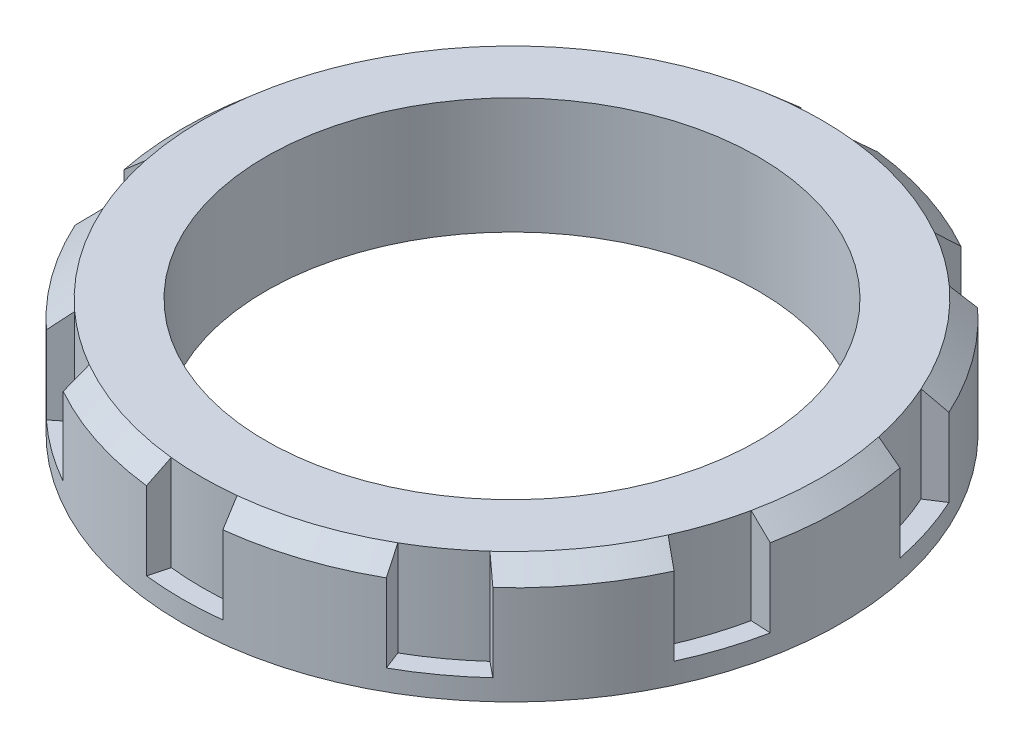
from build123d import *

# Parameters (mm, degrees)
CUT_EXTRUDE_START   = -5.5
SKETCH_2_R          = 25
CUT_EXTRUDE_1_DEPTH = 5.5


with BuildPart() as part:
    # Sketch 1 → Revolve 1 (revolve)
    with BuildSketch(Plane.XY, mode=Mode.PRIVATE) as revolve_1_sk:
        Polygon((-19, 5.7), (-19, 0), (-14.188, 0), (-14.188, 6.7), (-17.85, 6.7), align=None)
    revolve(revolve_1_sk.sketch.rotate(Axis((0, 6.7, 0), (0, -1, 0)), 90), axis=Axis((0, 6.7, 0), (0, -1, 0)))

    # Sketch 2 → Cut-Extrude 1 (cut)
    with BuildSketch(Plane(origin=(0, 6.7, 0), x_dir=(1, 0, 0), z_dir=(0, 1, 0)).offset(CUT_EXTRUDE_START)):
        Circle(SKETCH_2_R)
        with BuildLine():
            Line((-18.628367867, -3.739506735), (-17.467045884, -3.677609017))
            ThreePointArc((-17.467045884, -3.677609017), (-16.976358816, -5.51595335), (-16.292781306, -7.291623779))
            Line((-16.292781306, -7.291623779), (-17.268693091, -7.924155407))
            ThreePointArc((-17.268693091, -7.924155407), (-15.371322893, -11.167919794), (-12.872639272, -13.974804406))
            Line((-12.872639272, -13.974804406), (-11.969492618, -13.242120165))
            ThreePointArc((-11.969492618, -13.242120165), (-10.491966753, -14.44095335), (-8.895228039, -15.475704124))
            Line((-8.895228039, -15.475704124), (-9.312964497, -16.561059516))
            ThreePointArc((-9.312964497, -16.561059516), (-5.871322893, -18.07007381), (-2.2, -18.872201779))
            Line((-2.2, -18.872201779), (-1.9, -17.748591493))
            ThreePointArc((-1.9, -17.748591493), (0, -17.85), (1.9, -17.748591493))
            Line((1.9, -17.748591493), (2.2, -18.872201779))
            ThreePointArc((2.2, -18.872201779), (5.871322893, -18.07007381), (9.312964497, -16.561059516))
            Line((9.312964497, -16.561059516), (8.895228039, -15.475704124))
            ThreePointArc((8.895228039, -15.475704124), (10.491966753, -14.44095335), (11.969492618, -13.242120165))
            Line((11.969492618, -13.242120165), (12.872639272, -13.974804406))
            ThreePointArc((12.872639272, -13.974804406), (15.371322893, -11.167919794), (17.268693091, -7.924155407))
            Line((17.268693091, -7.924155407), (16.292781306, -7.291623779))
            ThreePointArc((16.292781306, -7.291623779), (16.976358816, -5.51595335), (17.467045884, -3.677609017))
            Line((17.467045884, -3.677609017), (18.628367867, -3.739506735))
            ThreePointArc((18.628367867, -3.739506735), (19, 0), (18.628367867, 3.739506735))
            Line((18.628367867, 3.739506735), (17.467045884, 3.677609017))
            ThreePointArc((17.467045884, 3.677609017), (16.976358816, 5.51595335), (16.292781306, 7.291623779))
            Line((16.292781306, 7.291623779), (17.268693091, 7.924155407))
            ThreePointArc((17.268693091, 7.924155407), (15.371322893, 11.167919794), (12.872639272, 13.974804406))
            Line((12.872639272, 13.974804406), (11.969492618, 13.242120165))
            ThreePointArc((11.969492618, 13.242120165), (10.491966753, 14.44095335), (8.895228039, 15.475704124))
            Line((8.895228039, 15.475704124), (9.312964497, 16.561059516))
            ThreePointArc((9.312964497, 16.561059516), (5.871322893, 18.07007381), (2.2, 18.872201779))
            Line((2.2, 18.872201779), (1.9, 17.748591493))
            ThreePointArc((1.9, 17.748591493), (0, 17.85), (-1.9, 17.748591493))
            Line((-1.9, 17.748591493), (-2.2, 18.872201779))
            ThreePointArc((-2.2, 18.872201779), (-5.871322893, 18.07007381), (-9.312964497, 16.561059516))
            Line((-9.312964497, 16.561059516), (-8.895228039, 15.475704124))
            ThreePointArc((-8.895228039, 15.475704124), (-10.491966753, 14.44095335), (-11.969492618, 13.242120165))
            Line((-11.969492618, 13.242120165), (-12.872639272, 13.974804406))
            ThreePointArc((-12.872639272, 13.974804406), (-15.371322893, 11.167919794), (-17.268693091, 7.924155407))
            Line((-17.268693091, 7.924155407), (-16.292781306, 7.291623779))
            ThreePointArc((-16.292781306, 7.291623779), (-16.976358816, 5.51595335), (-17.467045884, 3.677609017))
            Line((-17.467045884, 3.677609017), (-18.628367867, 3.739506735))
            ThreePointArc((-18.628367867, 3.739506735), (-19, 0), (-18.628367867, -3.739506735))
        make_face(mode=Mode.SUBTRACT)
    extrude(amount=CUT_EXTRUDE_1_DEPTH, mode=Mode.SUBTRACT)


solid = part.part
